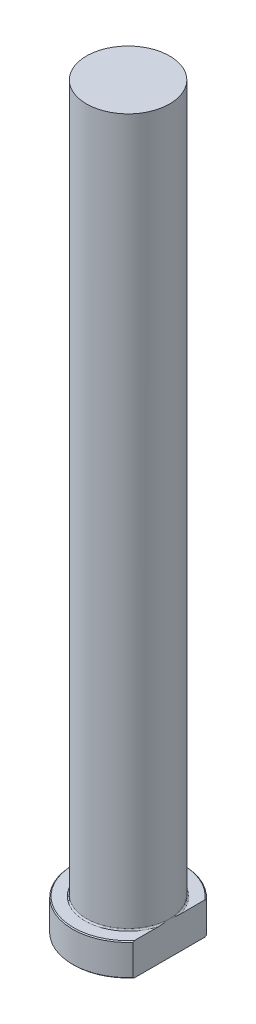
ISO-10303-21;
HEADER;
FILE_DESCRIPTION(('STEP AP214'),'2;1');
FILE_NAME('part.step','',(''),(''),'','','');
FILE_SCHEMA(('AUTOMOTIVE_DESIGN { 1 0 10303 214 1 1 1 1 }'));
ENDSEC;
DATA;
#1=APPLICATION_CONTEXT('core data for automotive mechanical design processes');
#2=APPLICATION_PROTOCOL_DEFINITION('international standard','automotive_design',2000,#1);
#3=PRODUCT_CONTEXT('',#1,'mechanical');
#4=PRODUCT('Part','Part','',(#3));
#5=PRODUCT_RELATED_PRODUCT_CATEGORY('part','',(#4));
#6=PRODUCT_DEFINITION_FORMATION('','',#4);
#7=PRODUCT_DEFINITION_CONTEXT('part definition',#1,'design');
#8=PRODUCT_DEFINITION('design','',#6,#7);
#9=PRODUCT_DEFINITION_SHAPE('','',#8);
#10=(LENGTH_UNIT() NAMED_UNIT(*) SI_UNIT(.MILLI.,.METRE.));
#11=(NAMED_UNIT(*) PLANE_ANGLE_UNIT() SI_UNIT($,.RADIAN.));
#12=(NAMED_UNIT(*) SI_UNIT($,.STERADIAN.) SOLID_ANGLE_UNIT());
#13=UNCERTAINTY_MEASURE_WITH_UNIT(LENGTH_MEASURE(1.E-05),#10,'distance_accuracy_value','');
#14=(GEOMETRIC_REPRESENTATION_CONTEXT(3) GLOBAL_UNCERTAINTY_ASSIGNED_CONTEXT((#13)) GLOBAL_UNIT_ASSIGNED_CONTEXT((#10,
#11,#12)) REPRESENTATION_CONTEXT('',''));
#15=CARTESIAN_POINT('',(0.,0.,0.));
#16=DIRECTION('',(0.,0.,1.));
#17=DIRECTION('',(1.,0.,0.));
#18=AXIS2_PLACEMENT_3D('',#15,#16,#17);
#19=CARTESIAN_POINT('',(0.,0.,0.));
#20=DIRECTION('',(0.,-1.,0.));
#21=DIRECTION('',(0.,0.,-1.));
#22=AXIS2_PLACEMENT_3D('',#19,#20,#21);
#23=PLANE('',#22);
#24=CARTESIAN_POINT('',(0.,0.,0.));
#25=DIRECTION('',(0.,-1.,0.));
#26=DIRECTION('',(0.,0.,-1.));
#27=AXIS2_PLACEMENT_3D('',#24,#25,#26);
#28=CIRCLE('',#27,11.8);
#29=CARTESIAN_POINT('',(8.99999999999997,0.,7.63151361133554));
#30=VERTEX_POINT('',#29);
#31=CARTESIAN_POINT('',(8.99999999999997,0.,-7.63151361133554));
#32=VERTEX_POINT('',#31);
#33=EDGE_CURVE('E98',#30,#32,#28,.T.);
#34=ORIENTED_EDGE('',*,*,#33,.T.);
#35=DIRECTION('',(0.,0.,1.));
#36=VECTOR('',#35,1.);
#37=CARTESIAN_POINT('',(8.99999999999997,0.,-7.93725393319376));
#38=LINE('',#37,#36);
#39=EDGE_CURVE('E83',#32,#30,#38,.T.);
#40=ORIENTED_EDGE('',*,*,#39,.T.);
#41=EDGE_LOOP('',(#34,#40));
#42=FACE_BOUND('',#41,.T.);
#43=ADVANCED_FACE('F32',(#42),#23,.T.);
#44=CARTESIAN_POINT('',(0.,259.958771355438,0.));
#45=DIRECTION('',(0.,1.,0.));
#46=DIRECTION('',(0.,0.,1.));
#47=AXIS2_PLACEMENT_3D('',#44,#45,#46);
#48=CYLINDRICAL_SURFACE('',#47,12.);
#49=CARTESIAN_POINT('',(0.,6.79999999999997,0.));
#50=DIRECTION('',(0.,1.,0.));
#51=DIRECTION('',(0.,0.,1.));
#52=AXIS2_PLACEMENT_3D('',#49,#50,#51);
#53=CIRCLE('',#52,12.);
#54=CARTESIAN_POINT('',(8.99999999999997,6.79999999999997,7.93725393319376));
#55=VERTEX_POINT('',#54);
#56=CARTESIAN_POINT('',(8.99999999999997,6.79999999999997,-7.93725393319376));
#57=VERTEX_POINT('',#56);
#58=EDGE_CURVE('E104',#55,#57,#53,.F.);
#59=ORIENTED_EDGE('',*,*,#58,.T.);
#60=DIRECTION('',(0.,-1.,0.));
#61=VECTOR('',#60,1.);
#62=CARTESIAN_POINT('',(8.99999999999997,160.,-7.93725393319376));
#63=LINE('',#62,#61);
#64=CARTESIAN_POINT('',(8.99999999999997,0.199999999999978,-7.93725393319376));
#65=VERTEX_POINT('',#64);
#66=EDGE_CURVE('E183',#57,#65,#63,.T.);
#67=ORIENTED_EDGE('',*,*,#66,.T.);
#68=CARTESIAN_POINT('',(0.,0.199999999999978,0.));
#69=DIRECTION('',(0.,-1.,0.));
#70=DIRECTION('',(0.,0.,-1.));
#71=AXIS2_PLACEMENT_3D('',#68,#69,#70);
#72=CIRCLE('',#71,12.);
#73=CARTESIAN_POINT('',(8.99999999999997,0.199999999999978,7.93725393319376));
#74=VERTEX_POINT('',#73);
#75=EDGE_CURVE('E100',#65,#74,#72,.F.);
#76=ORIENTED_EDGE('',*,*,#75,.T.);
#77=DIRECTION('',(0.,-1.,0.));
#78=VECTOR('',#77,1.);
#79=CARTESIAN_POINT('',(8.99999999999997,160.,7.93725393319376));
#80=LINE('',#79,#78);
#81=EDGE_CURVE('E93',#55,#74,#80,.T.);
#82=ORIENTED_EDGE('',*,*,#81,.F.);
#83=EDGE_LOOP('',(#59,#67,#76,#82));
#84=FACE_BOUND('',#83,.T.);
#85=ADVANCED_FACE('F158',(#84),#48,.T.);
#86=CARTESIAN_POINT('',(-12.,7.,0.));
#87=DIRECTION('',(0.,1.,0.));
#88=DIRECTION('',(0.,0.,1.));
#89=AXIS2_PLACEMENT_3D('',#86,#87,#88);
#90=PLANE('',#89);
#91=CARTESIAN_POINT('',(0.,7.,0.));
#92=DIRECTION('',(0.,1.,0.));
#93=DIRECTION('',(0.,0.,1.));
#94=AXIS2_PLACEMENT_3D('',#91,#92,#93);
#95=CIRCLE('',#94,11.8);
#96=CARTESIAN_POINT('',(8.99999999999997,7.,-7.63151361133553));
#97=VERTEX_POINT('',#96);
#98=CARTESIAN_POINT('',(8.99999999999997,7.,7.63151361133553));
#99=VERTEX_POINT('',#98);
#100=EDGE_CURVE('E178',#97,#99,#95,.T.);
#101=ORIENTED_EDGE('',*,*,#100,.T.);
#102=DIRECTION('',(0.,0.,-1.));
#103=VECTOR('',#102,1.);
#104=CARTESIAN_POINT('',(8.99999999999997,7.,0.));
#105=LINE('',#104,#103);
#106=CARTESIAN_POINT('',(8.99999999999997,6.99999999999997,2.34307490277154));
#107=VERTEX_POINT('',#106);
#108=EDGE_CURVE('E57',#99,#107,#105,.T.);
#109=ORIENTED_EDGE('',*,*,#108,.T.);
#110=CARTESIAN_POINT('',(0.,7.,0.));
#111=DIRECTION('',(0.,1.,0.));
#112=DIRECTION('',(0.,0.,1.));
#113=AXIS2_PLACEMENT_3D('',#110,#111,#112);
#114=CIRCLE('',#113,9.29999999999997);
#115=CARTESIAN_POINT('',(8.99999999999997,6.99999999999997,-2.34307490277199));
#116=VERTEX_POINT('',#115);
#117=EDGE_CURVE('E107',#107,#116,#114,.F.);
#118=ORIENTED_EDGE('',*,*,#117,.T.);
#119=EDGE_CURVE('E136',#116,#97,#105,.T.);
#120=ORIENTED_EDGE('',*,*,#119,.T.);
#121=EDGE_LOOP('',(#101,#109,#118,#120));
#122=FACE_BOUND('',#121,.T.);
#123=ADVANCED_FACE('F147',(#122),#90,.T.);
#124=CARTESIAN_POINT('',(0.,7.00000000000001,0.));
#125=DIRECTION('',(0.,-1.,0.));
#126=DIRECTION('',(0.,0.,-1.));
#127=AXIS2_PLACEMENT_3D('',#124,#125,#126);
#128=CONICAL_SURFACE('',#127,11.7999999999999,0.785398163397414);
#129=ORIENTED_EDGE('',*,*,#58,.F.);
#130=CARTESIAN_POINT('',(8.99999999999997,-0.845696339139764,17.4629145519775));
#131=CARTESIAN_POINT('',(8.99999999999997,-0.619168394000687,17.2080654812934));
#132=CARTESIAN_POINT('',(8.99999999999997,-0.393215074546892,16.9527052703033));
#133=CARTESIAN_POINT('',(8.99999999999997,0.0573779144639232,16.4408231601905));
#134=CARTESIAN_POINT('',(8.99999999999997,0.282017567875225,16.1843012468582));
#135=CARTESIAN_POINT('',(8.99999999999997,0.953874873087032,15.4126051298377));
#136=CARTESIAN_POINT('',(8.99999999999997,1.39886493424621,14.8954867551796));
#137=CARTESIAN_POINT('',(8.99999999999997,2.28707339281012,13.8475750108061));
#138=CARTESIAN_POINT('',(8.99999999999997,2.73018564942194,13.3166913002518));
#139=CARTESIAN_POINT('',(8.99999999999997,3.38667359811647,12.5137605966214));
#140=CARTESIAN_POINT('',(8.99999999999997,3.60411991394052,12.2450411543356));
#141=CARTESIAN_POINT('',(8.99999999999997,4.03580182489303,11.7050379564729));
#142=CARTESIAN_POINT('',(8.99999999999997,4.25003746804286,11.4337542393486));
#143=CARTESIAN_POINT('',(8.99999999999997,4.66485476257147,10.9008707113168));
#144=CARTESIAN_POINT('',(8.99999999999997,4.8656088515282,10.6394052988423));
#145=CARTESIAN_POINT('',(8.99999999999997,5.26299613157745,10.1133666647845));
#146=CARTESIAN_POINT('',(8.99999999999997,5.45962943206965,9.84879352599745));
#147=CARTESIAN_POINT('',(8.99999999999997,5.84808590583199,9.31586751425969));
#148=CARTESIAN_POINT('',(8.99999999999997,6.039905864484,9.04751229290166));
#149=CARTESIAN_POINT('',(8.99999999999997,6.41755379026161,8.5066135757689));
#150=CARTESIAN_POINT('',(8.99999999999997,6.60338186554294,8.23407015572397));
#151=CARTESIAN_POINT('',(8.99999999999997,6.96709703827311,7.68503423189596));
#152=CARTESIAN_POINT('',(8.99999999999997,7.14500871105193,7.40855806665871));
#153=CARTESIAN_POINT('',(8.99999999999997,7.49185621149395,6.84996824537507));
#154=CARTESIAN_POINT('',(8.99999999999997,7.66079116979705,6.56785404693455));
#155=CARTESIAN_POINT('',(8.99999999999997,7.98727106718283,5.99747808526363));
#156=CARTESIAN_POINT('',(8.99999999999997,8.14482812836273,5.70922330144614));
#157=CARTESIAN_POINT('',(8.99999999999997,8.4458607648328,5.12549650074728));
#158=CARTESIAN_POINT('',(8.99999999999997,8.58934045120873,4.83002662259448));
#159=CARTESIAN_POINT('',(8.99999999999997,8.84906483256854,4.25238874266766));
#160=CARTESIAN_POINT('',(8.99999999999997,8.96652090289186,3.97076984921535));
#161=CARTESIAN_POINT('',(8.99999999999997,9.1826864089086,3.40034514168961));
#162=CARTESIAN_POINT('',(8.99999999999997,9.28139598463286,3.1115393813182));
#163=CARTESIAN_POINT('',(8.99999999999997,9.4556676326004,2.52852903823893));
#164=CARTESIAN_POINT('',(8.99999999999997,9.53134480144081,2.23435935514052));
#165=CARTESIAN_POINT('',(8.99999999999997,9.65632576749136,1.64041484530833));
#166=CARTESIAN_POINT('',(8.99999999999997,9.70563300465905,1.34064075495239));
#167=CARTESIAN_POINT('',(8.99999999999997,9.77526514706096,0.73345334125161));
#168=CARTESIAN_POINT('',(8.99999999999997,9.79517814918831,0.425991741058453));
#169=CARTESIAN_POINT('',(8.99999999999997,9.80326622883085,-0.189338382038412));
#170=CARTESIAN_POINT('',(8.99999999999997,9.7914430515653,-0.497206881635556));
#171=CARTESIAN_POINT('',(8.99999999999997,9.73685194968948,-1.11106012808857));
#172=CARTESIAN_POINT('',(8.99999999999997,9.69399186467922,-1.41703652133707));
#173=CARTESIAN_POINT('',(8.99999999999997,9.58011156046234,-2.02367348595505));
#174=CARTESIAN_POINT('',(8.99999999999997,9.50908374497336,-2.32433260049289));
#175=CARTESIAN_POINT('',(8.99999999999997,9.31275981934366,-3.02635448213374));
#176=CARTESIAN_POINT('',(8.99999999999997,9.17712713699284,-3.42480429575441));
#177=CARTESIAN_POINT('',(8.99999999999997,8.87133996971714,-4.20817933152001));
#178=CARTESIAN_POINT('',(8.99999999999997,8.70116358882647,-4.59309579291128));
#179=CARTESIAN_POINT('',(8.99999999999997,8.42568509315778,-5.16277807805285));
#180=CARTESIAN_POINT('',(8.99999999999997,8.32997694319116,-5.3522881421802));
#181=CARTESIAN_POINT('',(8.99999999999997,8.13285287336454,-5.72832390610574));
#182=CARTESIAN_POINT('',(8.99999999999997,8.03143692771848,-5.91484959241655));
#183=CARTESIAN_POINT('',(8.99999999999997,7.8237269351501,-6.28506428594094));
#184=CARTESIAN_POINT('',(8.99999999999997,7.71743466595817,-6.46875429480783));
#185=CARTESIAN_POINT('',(8.99999999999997,7.50059460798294,-6.83359939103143));
#186=CARTESIAN_POINT('',(8.99999999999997,7.39004682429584,-7.01475448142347));
#187=CARTESIAN_POINT('',(8.99999999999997,7.12884885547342,-7.4330641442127));
#188=CARTESIAN_POINT('',(8.99999999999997,6.9768081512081,-7.66934990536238));
#189=CARTESIAN_POINT('',(8.99999999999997,6.66732030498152,-8.13836281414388));
#190=CARTESIAN_POINT('',(8.99999999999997,6.50987281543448,-8.37108973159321));
#191=CARTESIAN_POINT('',(8.99999999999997,6.19040265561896,-8.83345273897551));
#192=CARTESIAN_POINT('',(8.99999999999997,6.02837897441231,-9.06308812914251));
#193=CARTESIAN_POINT('',(8.99999999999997,5.70047733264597,-9.51959402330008));
#194=CARTESIAN_POINT('',(8.99999999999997,5.53459926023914,-9.74646444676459));
#195=CARTESIAN_POINT('',(8.99999999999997,5.03154469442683,-10.4241247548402));
#196=CARTESIAN_POINT('',(8.99999999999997,4.68944039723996,-10.8712583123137));
#197=CARTESIAN_POINT('',(8.99999999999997,3.9955806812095,-11.7578381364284));
#198=CARTESIAN_POINT('',(8.99999999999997,3.64382644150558,-12.1972853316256));
#199=CARTESIAN_POINT('',(8.99999999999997,2.95317269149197,-13.0452636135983));
#200=CARTESIAN_POINT('',(8.99999999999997,2.61468309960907,-13.4541293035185));
#201=CARTESIAN_POINT('',(8.99999999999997,1.93249184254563,-14.2675092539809));
#202=CARTESIAN_POINT('',(8.99999999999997,1.58878996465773,-14.6720233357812));
#203=CARTESIAN_POINT('',(8.99999999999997,0.898519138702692,-15.4759626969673));
#204=CARTESIAN_POINT('',(8.99999999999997,0.551965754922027,-15.8754013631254));
#205=CARTESIAN_POINT('',(8.99999999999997,-0.144511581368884,-16.6712645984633));
#206=CARTESIAN_POINT('',(8.99999999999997,-0.494435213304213,-17.0676894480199));
#207=CARTESIAN_POINT('',(8.99999999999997,-0.845696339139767,-17.4629145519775));
#208=B_SPLINE_CURVE_WITH_KNOTS('',3,(#130,#131,#132,#133,#134,#135,#136,#137,#138,#139,#140,
#141,#142,#143,#144,#145,#146,#147,#148,#149,#150,#151,#152,#153,#154,#155,#156,#157,#158,#159,
#160,#161,#162,#163,#164,#165,#166,#167,#168,#169,#170,#171,#172,#173,#174,#175,#176,#177,#178,
#179,#180,#181,#182,#183,#184,#185,#186,#187,#188,#189,#190,#191,#192,#193,#194,#195,#196,#197,
#198,#199,#200,#201,#202,#203,#204,#205,#206,#207),.UNSPECIFIED.,.F.,.F.,(4,2,2,2,2,2,2,2,2,2,2,
2,2,2,2,2,2,2,2,2,2,2,2,2,2,2,2,2,2,2,2,2,2,2,2,2,2,2,4),(0.,1.02291971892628,2.04585198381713,
4.09246471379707,6.16687312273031,7.20388686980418,8.24088509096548,9.22978878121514,
10.2186661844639,11.2081873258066,12.197690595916,13.1838703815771,14.1701455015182,
15.1553538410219,16.1402736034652,17.0551241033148,17.9699677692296,18.8801617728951,
19.7902370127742,20.7129479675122,21.6356081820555,22.5610194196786,23.4866803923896,
24.7471780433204,26.0084771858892,26.6453205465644,27.2821667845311,27.9187826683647,
28.5553977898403,29.3982316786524,30.2411198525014,31.0841957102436,31.9272960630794,
33.6160766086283,35.3046517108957,36.8969911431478,38.4893957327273,40.0758348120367,
41.6621244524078),.UNSPECIFIED.);
#209=EDGE_CURVE('E135',#55,#99,#208,.T.);
#210=ORIENTED_EDGE('',*,*,#209,.T.);
#211=ORIENTED_EDGE('',*,*,#100,.F.);
#212=EDGE_CURVE('E127',#97,#57,#208,.T.);
#213=ORIENTED_EDGE('',*,*,#212,.T.);
#214=EDGE_LOOP('',(#129,#210,#211,#213));
#215=FACE_BOUND('',#214,.T.);
#216=ADVANCED_FACE('F143',(#215),#128,.T.);
#217=CARTESIAN_POINT('',(0.,0.199999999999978,0.));
#218=DIRECTION('',(0.,1.,0.));
#219=DIRECTION('',(0.,0.,1.));
#220=AXIS2_PLACEMENT_3D('',#217,#218,#219);
#221=CONICAL_SURFACE('',#220,12.,0.785398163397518);
#222=ORIENTED_EDGE('',*,*,#75,.F.);
#223=CARTESIAN_POINT('',(8.99999999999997,7.84569633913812,-17.4629145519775));
#224=CARTESIAN_POINT('',(8.99999999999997,7.61916839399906,-17.2080654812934));
#225=CARTESIAN_POINT('',(8.99999999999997,7.39321507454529,-16.9527052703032));
#226=CARTESIAN_POINT('',(8.99999999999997,6.9426220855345,-16.4408231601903));
#227=CARTESIAN_POINT('',(8.99999999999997,6.71798243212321,-16.184301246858));
#228=CARTESIAN_POINT('',(8.99999999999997,6.04612512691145,-15.4126051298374));
#229=CARTESIAN_POINT('',(8.99999999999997,5.60113506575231,-14.8954867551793));
#230=CARTESIAN_POINT('',(8.99999999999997,4.71292660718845,-13.8475750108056));
#231=CARTESIAN_POINT('',(8.99999999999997,4.26981435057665,-13.3166913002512));
#232=CARTESIAN_POINT('',(8.99999999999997,3.61332640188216,-12.5137605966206));
#233=CARTESIAN_POINT('',(8.99999999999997,3.39588008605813,-12.2450411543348));
#234=CARTESIAN_POINT('',(8.99999999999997,2.96419817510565,-11.705037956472));
#235=CARTESIAN_POINT('',(8.99999999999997,2.74996253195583,-11.4337542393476));
#236=CARTESIAN_POINT('',(8.99999999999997,2.33514523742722,-10.9008707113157));
#237=CARTESIAN_POINT('',(8.99999999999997,2.13439114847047,-10.6394052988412));
#238=CARTESIAN_POINT('',(8.99999999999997,1.73700386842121,-10.1133666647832));
#239=CARTESIAN_POINT('',(8.99999999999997,1.54037056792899,-9.84879352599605));
#240=CARTESIAN_POINT('',(8.99999999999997,1.15191409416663,-9.31586751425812));
#241=CARTESIAN_POINT('',(8.99999999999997,0.960094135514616,-9.0475122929));
#242=CARTESIAN_POINT('',(8.99999999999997,0.582446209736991,-8.50661357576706));
#243=CARTESIAN_POINT('',(8.99999999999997,0.396618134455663,-8.23407015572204));
#244=CARTESIAN_POINT('',(8.99999999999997,0.0329029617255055,-7.68503423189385));
#245=CARTESIAN_POINT('',(8.99999999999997,-0.145008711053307,-7.4085580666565));
#246=CARTESIAN_POINT('',(8.99999999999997,-0.491856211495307,-6.84996824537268));
#247=CARTESIAN_POINT('',(8.99999999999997,-0.660791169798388,-6.56785404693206));
#248=CARTESIAN_POINT('',(8.99999999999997,-0.987271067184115,-5.99747808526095));
#249=CARTESIAN_POINT('',(8.99999999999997,-1.14482812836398,-5.70922330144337));
#250=CARTESIAN_POINT('',(8.99999999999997,-1.44586076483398,-5.12549650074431));
#251=CARTESIAN_POINT('',(8.99999999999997,-1.58934045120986,-4.8300266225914));
#252=CARTESIAN_POINT('',(8.99999999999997,-1.84906483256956,-4.25238874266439));
#253=CARTESIAN_POINT('',(8.99999999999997,-1.96652090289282,-3.970769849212));
#254=CARTESIAN_POINT('',(8.99999999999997,-2.18268640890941,-3.40034514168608));
#255=CARTESIAN_POINT('',(8.99999999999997,-2.28139598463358,-3.11153938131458));
#256=CARTESIAN_POINT('',(8.99999999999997,-2.45566763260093,-2.52852903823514));
#257=CARTESIAN_POINT('',(8.99999999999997,-2.53134480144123,-2.23435935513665));
#258=CARTESIAN_POINT('',(8.99999999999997,-2.65632576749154,-1.6404148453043));
#259=CARTESIAN_POINT('',(8.99999999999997,-2.70563300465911,-1.34064075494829));
#260=CARTESIAN_POINT('',(8.99999999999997,-2.77526514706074,-0.733453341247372));
#261=CARTESIAN_POINT('',(8.99999999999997,-2.79517814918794,-0.425991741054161));
#262=CARTESIAN_POINT('',(8.99999999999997,-2.80326622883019,0.189338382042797));
#263=CARTESIAN_POINT('',(8.99999999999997,-2.79144305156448,0.497206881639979));
#264=CARTESIAN_POINT('',(8.99999999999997,-2.73685194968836,1.11106012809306));
#265=CARTESIAN_POINT('',(8.99999999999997,-2.69399186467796,1.41703652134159));
#266=CARTESIAN_POINT('',(8.99999999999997,-2.5801115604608,2.02367348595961));
#267=CARTESIAN_POINT('',(8.99999999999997,-2.5090837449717,2.32433260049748));
#268=CARTESIAN_POINT('',(8.99999999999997,-2.3127598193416,3.02635448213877));
#269=CARTESIAN_POINT('',(8.99999999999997,-2.17712713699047,3.42480429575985));
#270=CARTESIAN_POINT('',(8.99999999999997,-1.87133996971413,4.20817933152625));
#271=CARTESIAN_POINT('',(8.99999999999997,-1.70116358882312,4.59309579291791));
#272=CARTESIAN_POINT('',(8.99999999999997,-1.42568509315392,5.16277807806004));
#273=CARTESIAN_POINT('',(8.99999999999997,-1.32997694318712,5.35228814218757));
#274=CARTESIAN_POINT('',(8.99999999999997,-1.13285287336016,5.72832390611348));
#275=CARTESIAN_POINT('',(8.99999999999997,-1.03143692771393,5.91484959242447));
#276=CARTESIAN_POINT('',(8.99999999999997,-0.823726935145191,6.28506428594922));
#277=CARTESIAN_POINT('',(8.99999999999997,-0.717434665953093,6.46875429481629));
#278=CARTESIAN_POINT('',(8.99999999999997,-0.500594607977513,6.83359939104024));
#279=CARTESIAN_POINT('',(8.99999999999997,-0.390046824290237,7.01475448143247));
#280=CARTESIAN_POINT('',(8.99999999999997,-0.128848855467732,7.4330641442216));
#281=CARTESIAN_POINT('',(8.99999999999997,0.0231918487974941,7.66934990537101));
#282=CARTESIAN_POINT('',(8.99999999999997,0.332679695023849,8.13836281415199));
#283=CARTESIAN_POINT('',(8.99999999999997,0.490127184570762,8.37108973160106));
#284=CARTESIAN_POINT('',(8.99999999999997,0.809597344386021,8.83345273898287));
#285=CARTESIAN_POINT('',(8.99999999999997,0.971621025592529,9.06308812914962));
#286=CARTESIAN_POINT('',(8.99999999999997,1.29952266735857,9.51959402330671));
#287=CARTESIAN_POINT('',(8.99999999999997,1.46540073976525,9.74646444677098));
#288=CARTESIAN_POINT('',(8.99999999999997,1.96845530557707,10.4241247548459));
#289=CARTESIAN_POINT('',(8.99999999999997,2.3105596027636,10.8712583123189));
#290=CARTESIAN_POINT('',(8.99999999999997,3.00441931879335,11.7578381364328));
#291=CARTESIAN_POINT('',(8.99999999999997,3.35617355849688,12.1972853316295));
#292=CARTESIAN_POINT('',(8.99999999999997,4.04682730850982,13.0452636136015));
#293=CARTESIAN_POINT('',(8.99999999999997,4.38531690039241,13.4541293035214));
#294=CARTESIAN_POINT('',(8.99999999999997,5.06750815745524,14.2675092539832));
#295=CARTESIAN_POINT('',(8.99999999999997,5.41121003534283,14.6720233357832));
#296=CARTESIAN_POINT('',(8.99999999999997,6.10148086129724,15.4759626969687));
#297=CARTESIAN_POINT('',(8.99999999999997,6.4480342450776,15.8754013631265));
#298=CARTESIAN_POINT('',(8.99999999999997,7.14451158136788,16.6712645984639));
#299=CARTESIAN_POINT('',(8.99999999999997,7.49443521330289,17.0676894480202));
#300=CARTESIAN_POINT('',(8.99999999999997,7.84569633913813,17.4629145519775));
#301=B_SPLINE_CURVE_WITH_KNOTS('',3,(#223,#224,#225,#226,#227,#228,#229,#230,#231,#232,#233,
#234,#235,#236,#237,#238,#239,#240,#241,#242,#243,#244,#245,#246,#247,#248,#249,#250,#251,#252,
#253,#254,#255,#256,#257,#258,#259,#260,#261,#262,#263,#264,#265,#266,#267,#268,#269,#270,#271,
#272,#273,#274,#275,#276,#277,#278,#279,#280,#281,#282,#283,#284,#285,#286,#287,#288,#289,#290,
#291,#292,#293,#294,#295,#296,#297,#298,#299,#300),.UNSPECIFIED.,.F.,.F.,(4,2,2,2,2,2,2,2,2,2,2,
2,2,2,2,2,2,2,2,2,2,2,2,2,2,2,2,2,2,2,2,2,2,2,2,2,2,2,4),(0.,1.02291971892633,2.04585198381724,
4.09246471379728,6.16687312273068,7.20388686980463,8.240885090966,9.22978878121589,
10.2186661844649,11.2081873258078,12.1976905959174,13.1838703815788,14.1701455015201,
15.155353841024,16.1402736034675,17.0551241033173,17.9699677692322,18.8801617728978,
19.7902370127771,20.7129479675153,21.6356081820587,22.561019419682,23.4866803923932,
24.7471780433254,26.0084771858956,26.6453205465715,27.282166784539,27.9187826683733,
28.5553977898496,29.3982316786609,30.2411198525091,31.0841957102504,31.9272960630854,
33.6160766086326,35.3046517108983,36.8969911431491,38.4893957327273,40.0758348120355,
41.6621244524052),.UNSPECIFIED.);
#302=EDGE_CURVE('E86',#65,#32,#301,.T.);
#303=ORIENTED_EDGE('',*,*,#302,.T.);
#304=ORIENTED_EDGE('',*,*,#33,.F.);
#305=EDGE_CURVE('E89',#30,#74,#301,.T.);
#306=ORIENTED_EDGE('',*,*,#305,.T.);
#307=EDGE_LOOP('',(#222,#303,#304,#306));
#308=FACE_BOUND('',#307,.T.);
#309=ADVANCED_FACE('F97',(#308),#221,.T.);
#310=CARTESIAN_POINT('',(0.,7.29999999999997,0.));
#311=DIRECTION('',(0.,1.,0.));
#312=DIRECTION('',(0.,0.,1.));
#313=AXIS2_PLACEMENT_3D('',#310,#311,#312);
#314=TOROIDAL_SURFACE('',#313,9.29999999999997,0.3);
#315=CARTESIAN_POINT('',(8.99999999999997,7.29999999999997,0.));
#316=CARTESIAN_POINT('',(8.99999999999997,7.30000063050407,1.40628521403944E-10));
#317=CARTESIAN_POINT('',(8.99999999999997,7.30000126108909,-3.72953344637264E-07));
#318=CARTESIAN_POINT('',(8.99999999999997,7.30000242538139,-1.31879172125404E-06));
#319=CARTESIAN_POINT('',(8.99999999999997,7.30000291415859,-1.91658985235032E-06));
#320=CARTESIAN_POINT('',(8.99999999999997,7.30000399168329,-3.38116402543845E-06));
#321=CARTESIAN_POINT('',(8.99999999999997,7.30000455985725,-4.27141237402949E-06));
#322=CARTESIAN_POINT('',(8.99999999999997,7.30000552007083,-6.05655817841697E-06));
#323=CARTESIAN_POINT('',(8.99999999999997,7.30000592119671,-6.9473471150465E-06));
#324=CARTESIAN_POINT('',(8.99999999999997,7.30000753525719,-1.06072217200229E-05));
#325=CARTESIAN_POINT('',(8.99999999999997,7.30000869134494,-1.34079715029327E-05));
#326=CARTESIAN_POINT('',(8.99999999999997,7.30001046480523,-1.87883419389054E-05));
#327=CARTESIAN_POINT('',(8.99999999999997,7.30001113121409,-2.13522964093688E-05));
#328=CARTESIAN_POINT('',(8.99999999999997,7.30001412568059,-3.27400407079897E-05));
#329=CARTESIAN_POINT('',(8.99999999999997,7.30001653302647,-4.15431816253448E-05));
#330=CARTESIAN_POINT('',(8.99999999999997,7.30001987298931,-5.77938726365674E-05));
#331=CARTESIAN_POINT('',(8.99999999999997,7.3000209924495,-6.5202010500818E-05));
#332=CARTESIAN_POINT('',(8.99999999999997,7.30002942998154,-0.000121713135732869));
#333=CARTESIAN_POINT('',(8.99999999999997,7.30003617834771,-0.000170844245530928));
#334=CARTESIAN_POINT('',(8.99999999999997,7.30006567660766,-0.00036702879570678));
#335=CARTESIAN_POINT('',(8.99999999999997,7.30009343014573,-0.00051334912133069));
#336=CARTESIAN_POINT('',(8.99999999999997,7.30020289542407,-0.00109844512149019));
#337=CARTESIAN_POINT('',(8.99999999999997,7.30028164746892,-0.00153755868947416));
#338=CARTESIAN_POINT('',(8.99999999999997,7.30059984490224,-0.00330079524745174));
#339=CARTESIAN_POINT('',(8.99999999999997,7.30084318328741,-0.00462444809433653));
#340=CARTESIAN_POINT('',(8.99999999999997,7.30186346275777,-0.0101867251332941));
#341=CARTESIAN_POINT('',(8.99999999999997,7.30263548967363,-0.0144259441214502));
#342=CARTESIAN_POINT('',(8.99999999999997,7.31325744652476,-0.0727359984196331));
#343=CARTESIAN_POINT('',(8.99999999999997,7.32313962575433,-0.1268031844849));
#344=CARTESIAN_POINT('',(8.99999999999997,7.34392153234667,-0.241097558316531));
#345=CARTESIAN_POINT('',(8.99999999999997,7.35480932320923,-0.301326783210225));
#346=CARTESIAN_POINT('',(8.99999999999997,7.37309736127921,-0.40343148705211));
#347=CARTESIAN_POINT('',(8.99999999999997,7.3805477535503,-0.445297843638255));
#348=CARTESIAN_POINT('',(8.99999999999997,7.39510453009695,-0.527858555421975));
#349=CARTESIAN_POINT('',(8.99999999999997,7.40221466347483,-0.568552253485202));
#350=CARTESIAN_POINT('',(8.99999999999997,7.43458159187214,-0.755924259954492));
#351=CARTESIAN_POINT('',(8.99999999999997,7.45890071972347,-0.902767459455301));
#352=CARTESIAN_POINT('',(8.99999999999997,7.5040883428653,-1.19870226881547));
#353=CARTESIAN_POINT('',(8.99999999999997,7.52491482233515,-1.34780055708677));
#354=CARTESIAN_POINT('',(8.99999999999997,7.55251893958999,-1.57943061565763));
#355=CARTESIAN_POINT('',(8.99999999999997,7.56140010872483,-1.66170929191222));
#356=CARTESIAN_POINT('',(8.99999999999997,7.57684365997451,-1.82648173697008));
#357=CARTESIAN_POINT('',(8.99999999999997,7.58340627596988,-1.90897548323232));
#358=CARTESIAN_POINT('',(8.99999999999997,7.59356547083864,-2.07383798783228));
#359=CARTESIAN_POINT('',(8.99999999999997,7.59717316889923,-2.15620603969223));
#360=CARTESIAN_POINT('',(8.99999999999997,7.60060935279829,-2.32101209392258));
#361=CARTESIAN_POINT('',(8.99999999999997,7.60043940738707,-2.40345005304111));
#362=CARTESIAN_POINT('',(8.99999999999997,7.59640131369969,-2.52537573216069));
#363=CARTESIAN_POINT('',(8.99999999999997,7.59450012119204,-2.56492910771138));
#364=CARTESIAN_POINT('',(8.99999999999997,7.58928802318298,-2.64396909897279));
#365=CARTESIAN_POINT('',(8.99999999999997,7.58597630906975,-2.68345566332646));
#366=CARTESIAN_POINT('',(8.99999999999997,7.57769868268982,-2.76177296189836));
#367=CARTESIAN_POINT('',(8.99999999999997,7.57275348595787,-2.80060581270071));
#368=CARTESIAN_POINT('',(8.99999999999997,7.56078540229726,-2.87793166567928));
#369=CARTESIAN_POINT('',(8.99999999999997,7.55376374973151,-2.91642485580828));
#370=CARTESIAN_POINT('',(8.99999999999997,7.53694450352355,-2.99313780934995));
#371=CARTESIAN_POINT('',(8.99999999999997,7.52712658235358,-3.03135338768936));
#372=CARTESIAN_POINT('',(8.99999999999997,7.50944673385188,-3.08780831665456));
#373=CARTESIAN_POINT('',(8.99999999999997,7.50305127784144,-3.10650508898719));
#374=CARTESIAN_POINT('',(8.99999999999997,7.48902548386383,-3.14342466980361));
#375=CARTESIAN_POINT('',(8.99999999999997,7.48139609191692,-3.16164782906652));
#376=CARTESIAN_POINT('',(8.99999999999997,7.46450585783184,-3.19743301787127));
#377=CARTESIAN_POINT('',(8.99999999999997,7.4552376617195,-3.2149916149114));
#378=CARTESIAN_POINT('',(8.99999999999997,7.43454972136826,-3.24876333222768));
#379=CARTESIAN_POINT('',(8.99999999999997,7.42314087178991,-3.26498269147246));
#380=CARTESIAN_POINT('',(8.99999999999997,7.40450419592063,-3.28646803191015));
#381=CARTESIAN_POINT('',(8.99999999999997,7.39850345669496,-3.29278935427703));
#382=CARTESIAN_POINT('',(8.99999999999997,7.38579421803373,-3.30471156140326));
#383=CARTESIAN_POINT('',(8.99999999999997,7.37908470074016,-3.31031138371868));
#384=CARTESIAN_POINT('',(8.99999999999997,7.36478588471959,-3.32053638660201));
#385=CARTESIAN_POINT('',(8.99999999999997,7.35718475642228,-3.32514544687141));
#386=CARTESIAN_POINT('',(8.99999999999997,7.34122980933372,-3.33278362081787));
#387=CARTESIAN_POINT('',(8.99999999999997,7.33287931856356,-3.33581935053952));
#388=CARTESIAN_POINT('',(8.99999999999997,7.31845330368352,-3.33919143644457));
#389=CARTESIAN_POINT('',(8.99999999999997,7.3125065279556,-3.34008113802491));
#390=CARTESIAN_POINT('',(8.99999999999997,7.30054756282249,-3.34082795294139));
#391=CARTESIAN_POINT('',(8.99999999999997,7.29453539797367,-3.34068544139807));
#392=CARTESIAN_POINT('',(8.99999999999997,7.28263753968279,-3.33938340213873));
#393=CARTESIAN_POINT('',(8.99999999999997,7.2767516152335,-3.3382259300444));
#394=CARTESIAN_POINT('',(8.99999999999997,7.26523345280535,-3.33500803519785));
#395=CARTESIAN_POINT('',(8.99999999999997,7.25960143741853,-3.33294683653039));
#396=CARTESIAN_POINT('',(8.99999999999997,7.24614810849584,-3.32695048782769));
#397=CARTESIAN_POINT('',(8.99999999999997,7.23851777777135,-3.32258952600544));
#398=CARTESIAN_POINT('',(8.99999999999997,7.22402940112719,-3.31273429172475));
#399=CARTESIAN_POINT('',(8.99999999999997,7.21717355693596,-3.3072369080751));
#400=CARTESIAN_POINT('',(8.99999999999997,7.19922025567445,-3.29098261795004));
#401=CARTESIAN_POINT('',(8.99999999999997,7.18887056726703,-3.27940951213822));
#402=CARTESIAN_POINT('',(8.99999999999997,7.16988044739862,-3.25496698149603));
#403=CARTESIAN_POINT('',(8.99999999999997,7.16124389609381,-3.24209471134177));
#404=CARTESIAN_POINT('',(8.99999999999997,7.14198013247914,-3.2101081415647));
#405=CARTESIAN_POINT('',(8.99999999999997,7.1320002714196,-3.1906083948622));
#406=CARTESIAN_POINT('',(8.99999999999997,7.11389041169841,-3.15075380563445));
#407=CARTESIAN_POINT('',(8.99999999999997,7.10576438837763,-3.13039723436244));
#408=CARTESIAN_POINT('',(8.99999999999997,7.09086324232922,-3.08897345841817));
#409=CARTESIAN_POINT('',(8.99999999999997,7.08410231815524,-3.06790120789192));
#410=CARTESIAN_POINT('',(8.99999999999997,7.07174209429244,-3.02545099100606));
#411=CARTESIAN_POINT('',(8.99999999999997,7.06614150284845,-3.00407339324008));
#412=CARTESIAN_POINT('',(8.99999999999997,7.05234584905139,-2.94629140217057));
#413=CARTESIAN_POINT('',(8.99999999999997,7.04502112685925,-2.90967972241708));
#414=CARTESIAN_POINT('',(8.99999999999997,7.03240402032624,-2.8361022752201));
#415=CARTESIAN_POINT('',(8.99999999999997,7.02711280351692,-2.79913631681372));
#416=CARTESIAN_POINT('',(8.99999999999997,7.01363050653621,-2.68772710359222));
#417=CARTESIAN_POINT('',(8.99999999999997,7.00787651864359,-2.61298996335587));
#418=CARTESIAN_POINT('',(8.99999999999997,7.00101064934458,-2.46619763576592));
#419=CARTESIAN_POINT('',(8.99999999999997,6.99973066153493,-2.39414846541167));
#420=CARTESIAN_POINT('',(8.99999999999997,7.0003597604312,-2.25048360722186));
#421=CARTESIAN_POINT('',(8.99999999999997,7.00225057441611,-2.17886780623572));
#422=CARTESIAN_POINT('',(8.99999999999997,7.00865827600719,-2.0325544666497));
#423=CARTESIAN_POINT('',(8.99999999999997,7.01328875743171,-1.95786225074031));
#424=CARTESIAN_POINT('',(8.99999999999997,7.0247141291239,-1.80868969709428));
#425=CARTESIAN_POINT('',(8.99999999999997,7.03150781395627,-1.73420926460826));
#426=CARTESIAN_POINT('',(8.99999999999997,7.04702589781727,-1.583650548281));
#427=CARTESIAN_POINT('',(8.99999999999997,7.05579262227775,-1.50757669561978));
#428=CARTESIAN_POINT('',(8.99999999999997,7.07482366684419,-1.35540828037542));
#429=CARTESIAN_POINT('',(8.99999999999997,7.08509200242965,-1.27931422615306));
#430=CARTESIAN_POINT('',(8.99999999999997,7.11096614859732,-1.09814766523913));
#431=CARTESIAN_POINT('',(8.99999999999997,7.12710877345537,-0.993152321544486));
#432=CARTESIAN_POINT('',(8.99999999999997,7.16076002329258,-0.784642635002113));
#433=CARTESIAN_POINT('',(8.99999999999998,7.17825049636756,-0.681125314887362));
#434=CARTESIAN_POINT('',(8.99999999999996,7.21207189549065,-0.486473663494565));
#435=CARTESIAN_POINT('',(8.99999999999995,7.22829584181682,-0.395320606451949));
#436=CARTESIAN_POINT('',(8.99999999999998,7.25335230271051,-0.256199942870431));
#437=CARTESIAN_POINT('',(9.,7.26204965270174,-0.208207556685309));
#438=CARTESIAN_POINT('',(8.99999999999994,7.27937243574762,-0.113033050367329));
#439=CARTESIAN_POINT('',(8.99999999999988,7.2879966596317,-0.0658507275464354));
#440=CARTESIAN_POINT('',(8.99999999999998,7.29736684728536,-0.0144131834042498));
#441=CARTESIAN_POINT('',(8.99999999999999,7.29814117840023,-0.0101611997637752));
#442=CARTESIAN_POINT('',(8.99999999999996,7.29916198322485,-0.00459610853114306));
#443=CARTESIAN_POINT('',(8.99999999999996,7.29940349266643,-0.00328239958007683));
#444=CARTESIAN_POINT('',(8.99999999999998,7.29971946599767,-0.00153148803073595));
#445=CARTESIAN_POINT('',(8.99999999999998,7.2997977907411,-0.00109475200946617));
#446=CARTESIAN_POINT('',(8.99999999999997,7.29990674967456,-0.000512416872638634));
#447=CARTESIAN_POINT('',(8.99999999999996,7.29993443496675,-0.000366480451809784));
#448=CARTESIAN_POINT('',(8.99999999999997,7.29996386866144,-0.00017073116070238));
#449=CARTESIAN_POINT('',(8.99999999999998,7.29997060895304,-0.000121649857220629));
#450=CARTESIAN_POINT('',(8.99999999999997,7.29997903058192,-6.51901500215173E-05));
#451=CARTESIAN_POINT('',(8.99999999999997,7.29998014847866,-5.7784383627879E-05));
#452=CARTESIAN_POINT('',(8.99999999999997,7.29998348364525,-4.15389236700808E-05));
#453=CARTESIAN_POINT('',(8.99999999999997,7.29998588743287,-3.27385309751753E-05));
#454=CARTESIAN_POINT('',(8.99999999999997,7.29998887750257,-2.13537218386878E-05));
#455=CARTESIAN_POINT('',(8.99999999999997,7.29998954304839,-1.87899411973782E-05));
#456=CARTESIAN_POINT('',(8.99999999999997,7.29999131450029,-1.34098146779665E-05));
#457=CARTESIAN_POINT('',(8.99999999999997,7.29999246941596,-1.0609109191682E-05));
#458=CARTESIAN_POINT('',(8.99999999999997,7.29999408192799,-6.94916941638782E-06));
#459=CARTESIAN_POINT('',(8.99999999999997,7.29999448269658,-6.05831006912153E-06));
#460=CARTESIAN_POINT('',(8.99999999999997,7.29999544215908,-4.27295929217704E-06));
#461=CARTESIAN_POINT('',(8.99999999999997,7.29999600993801,-3.38257168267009E-06));
#462=CARTESIAN_POINT('',(8.99999999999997,7.29999708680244,-1.91768845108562E-06));
#463=CARTESIAN_POINT('',(8.99999999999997,7.29999757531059,-1.3197344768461E-06));
#464=CARTESIAN_POINT('',(8.99999999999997,7.29999873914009,-3.73475936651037E-07));
#465=CARTESIAN_POINT('',(8.99999999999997,7.29999936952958,-1.40621003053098E-10));
#466=CARTESIAN_POINT('',(8.99999999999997,7.29999999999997,0.));
#467=B_SPLINE_CURVE_WITH_KNOTS('',3,(#315,#316,#317,#318,#319,#320,#321,#322,#323,#324,#325,
#326,#327,#328,#329,#330,#331,#332,#333,#334,#335,#336,#337,#338,#339,#340,#341,#342,#343,#344,
#345,#346,#347,#348,#349,#350,#351,#352,#353,#354,#355,#356,#357,#358,#359,#360,#361,#362,#363,
#364,#365,#366,#367,#368,#369,#370,#371,#372,#373,#374,#375,#376,#377,#378,#379,#380,#381,#382,
#383,#384,#385,#386,#387,#388,#389,#390,#391,#392,#393,#394,#395,#396,#397,#398,#399,#400,#401,
#402,#403,#404,#405,#406,#407,#408,#409,#410,#411,#412,#413,#414,#415,#416,#417,#418,#419,#420,
#421,#422,#423,#424,#425,#426,#427,#428,#429,#430,#431,#432,#433,#434,#435,#436,#437,#438,#439,
#440,#441,#442,#443,#444,#445,#446,#447,#448,#449,#450,#451,#452,#453,#454,#455,#456,#457,#458,
#459,#460,#461,#462,#463,#464,#465,#466),.UNSPECIFIED.,.T.,.F.,(4,2,2,2,2,2,2,2,2,2,2,2,2,2,2,2,
2,2,2,2,2,2,2,2,2,2,2,2,2,2,2,2,2,2,2,2,2,2,2,2,2,2,2,2,2,2,2,2,2,2,2,2,2,2,2,2,2,2,2,2,2,2,2,2,
2,2,2,2,2,2,2,2,2,2,2,4),(0.,1.9618165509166E-06,4.31785402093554E-06,7.45492696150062E-06,
1.03869199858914E-05,1.94514161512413E-05,2.73914962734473E-05,5.47432539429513E-05,
7.71990234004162E-05,0.000226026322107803,0.000672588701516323,0.00201119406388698,
0.00604839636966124,0.0189755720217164,0.183861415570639,0.367478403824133,0.495050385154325,
0.618980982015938,1.06548941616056,1.51703428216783,1.76527968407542,2.01350003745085,
2.26078200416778,2.50796128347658,2.62673893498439,2.74558477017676,2.86297785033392,
2.98030128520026,3.09850038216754,3.15775069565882,3.2169557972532,3.27643364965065,
3.33561662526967,3.36172163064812,3.38786464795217,3.41440531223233,3.4408334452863,
3.45879041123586,3.47674085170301,3.49465502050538,3.51258460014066,3.53879954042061,
3.56508722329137,3.61140219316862,3.65782089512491,3.72337768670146,3.78907376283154,
3.85542145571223,3.92169488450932,4.03362051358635,4.14561030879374,4.37025392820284,
4.58636028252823,4.80122553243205,5.02569406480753,5.25003773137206,5.47975187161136,
5.71009192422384,6.02876014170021,6.3437072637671,6.62146210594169,6.76778501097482,
6.91167467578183,6.92464076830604,6.92864764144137,6.92997899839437,6.93042439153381,
6.93057306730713,6.93059551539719,6.93062285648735,6.93063079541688,6.93063985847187,
6.93064279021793,6.93064592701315,6.93064828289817,6.93065024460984),.UNSPECIFIED.);
#468=CARTESIAN_POINT('',(8.99999999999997,7.29999999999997,0.));
#469=VERTEX_POINT('',#468);
#470=EDGE_CURVE('E11',#116,#469,#467,.T.);
#471=ORIENTED_EDGE('',*,*,#470,.F.);
#472=ORIENTED_EDGE('',*,*,#117,.F.);
#473=CARTESIAN_POINT('',(8.99999999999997,7.29999999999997,0.));
#474=CARTESIAN_POINT('',(8.99999999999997,7.29999936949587,-1.40628685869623E-10));
#475=CARTESIAN_POINT('',(8.99999999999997,7.29999873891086,3.72953344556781E-07));
#476=CARTESIAN_POINT('',(8.99999999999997,7.29999757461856,1.31879172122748E-06));
#477=CARTESIAN_POINT('',(8.99999999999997,7.29999708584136,1.9165898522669E-06));
#478=CARTESIAN_POINT('',(8.99999999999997,7.29999600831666,3.3811640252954E-06));
#479=CARTESIAN_POINT('',(8.99999999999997,7.2999954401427,4.27141237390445E-06));
#480=CARTESIAN_POINT('',(8.99999999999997,7.29999447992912,6.05655817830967E-06));
#481=CARTESIAN_POINT('',(8.99999999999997,7.29999407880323,6.94734711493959E-06));
#482=CARTESIAN_POINT('',(8.99999999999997,7.29999246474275,1.06072217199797E-05));
#483=CARTESIAN_POINT('',(8.99999999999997,7.299991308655,1.34079715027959E-05));
#484=CARTESIAN_POINT('',(8.99999999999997,7.29998953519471,1.87883419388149E-05));
#485=CARTESIAN_POINT('',(8.99999999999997,7.29998886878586,2.13522964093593E-05));
#486=CARTESIAN_POINT('',(8.99999999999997,7.29998587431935,3.2740040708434E-05));
#487=CARTESIAN_POINT('',(8.99999999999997,7.29998346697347,4.15431816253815E-05));
#488=CARTESIAN_POINT('',(8.99999999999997,7.29998012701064,5.77938726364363E-05));
#489=CARTESIAN_POINT('',(8.99999999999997,7.29997900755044,6.52020105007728E-05));
#490=CARTESIAN_POINT('',(8.99999999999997,7.29997057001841,0.000121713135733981));
#491=CARTESIAN_POINT('',(8.99999999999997,7.29996382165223,0.000170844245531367));
#492=CARTESIAN_POINT('',(8.99999999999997,7.29993432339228,0.000367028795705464));
#493=CARTESIAN_POINT('',(8.99999999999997,7.29990656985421,0.000513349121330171));
#494=CARTESIAN_POINT('',(8.99999999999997,7.29979710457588,0.00109844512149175));
#495=CARTESIAN_POINT('',(8.99999999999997,7.29971835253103,0.00153755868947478));
#496=CARTESIAN_POINT('',(8.99999999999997,7.29940015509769,0.00330079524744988));
#497=CARTESIAN_POINT('',(8.99999999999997,7.29915681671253,0.00462444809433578));
#498=CARTESIAN_POINT('',(8.99999999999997,7.29813653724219,0.0101867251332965));
#499=CARTESIAN_POINT('',(8.99999999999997,7.29736451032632,0.0144259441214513));
#500=CARTESIAN_POINT('',(8.99999999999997,7.28674255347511,0.0727359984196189));
#501=CARTESIAN_POINT('',(8.99999999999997,7.27686037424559,0.126803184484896));
#502=CARTESIAN_POINT('',(8.99999999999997,7.2560784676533,0.241097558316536));
#503=CARTESIAN_POINT('',(8.99999999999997,7.24519067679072,0.301326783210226));
#504=CARTESIAN_POINT('',(8.99999999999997,7.22690263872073,0.403431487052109));
#505=CARTESIAN_POINT('',(8.99999999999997,7.21945224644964,0.445297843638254));
#506=CARTESIAN_POINT('',(8.99999999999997,7.204895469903,0.527858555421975));
#507=CARTESIAN_POINT('',(8.99999999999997,7.19778533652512,0.568552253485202));
#508=CARTESIAN_POINT('',(8.99999999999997,7.1654184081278,0.755924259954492));
#509=CARTESIAN_POINT('',(8.99999999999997,7.14109928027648,0.902767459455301));
#510=CARTESIAN_POINT('',(8.99999999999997,7.09591165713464,1.19870226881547));
#511=CARTESIAN_POINT('',(8.99999999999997,7.0750851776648,1.34780055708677));
#512=CARTESIAN_POINT('',(8.99999999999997,7.04748106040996,1.57943061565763));
#513=CARTESIAN_POINT('',(8.99999999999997,7.03859989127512,1.66170929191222));
#514=CARTESIAN_POINT('',(8.99999999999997,7.02315634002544,1.82648173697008));
#515=CARTESIAN_POINT('',(8.99999999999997,7.01659372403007,1.90897548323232));
#516=CARTESIAN_POINT('',(8.99999999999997,7.00643452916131,2.07383798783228));
#517=CARTESIAN_POINT('',(8.99999999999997,7.00282683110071,2.15620603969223));
#518=CARTESIAN_POINT('',(8.99999999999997,6.99939064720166,2.32101209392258));
#519=CARTESIAN_POINT('',(8.99999999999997,6.99956059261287,2.40345005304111));
#520=CARTESIAN_POINT('',(8.99999999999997,7.00359868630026,2.52537573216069));
#521=CARTESIAN_POINT('',(8.99999999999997,7.00549987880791,2.56492910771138));
#522=CARTESIAN_POINT('',(8.99999999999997,7.01071197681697,2.64396909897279));
#523=CARTESIAN_POINT('',(8.99999999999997,7.01402369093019,2.68345566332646));
#524=CARTESIAN_POINT('',(8.99999999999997,7.02230131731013,2.76177296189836));
#525=CARTESIAN_POINT('',(8.99999999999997,7.02724651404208,2.80060581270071));
#526=CARTESIAN_POINT('',(8.99999999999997,7.03921459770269,2.87793166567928));
#527=CARTESIAN_POINT('',(8.99999999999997,7.04623625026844,2.91642485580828));
#528=CARTESIAN_POINT('',(8.99999999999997,7.0630554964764,2.99313780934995));
#529=CARTESIAN_POINT('',(8.99999999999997,7.07287341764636,3.03135338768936));
#530=CARTESIAN_POINT('',(8.99999999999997,7.09055326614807,3.08780831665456));
#531=CARTESIAN_POINT('',(8.99999999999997,7.09694872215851,3.10650508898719));
#532=CARTESIAN_POINT('',(8.99999999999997,7.11097451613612,3.14342466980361));
#533=CARTESIAN_POINT('',(8.99999999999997,7.11860390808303,3.16164782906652));
#534=CARTESIAN_POINT('',(8.99999999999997,7.1354941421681,3.19743301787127));
#535=CARTESIAN_POINT('',(8.99999999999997,7.14476233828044,3.2149916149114));
#536=CARTESIAN_POINT('',(8.99999999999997,7.16545027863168,3.24876333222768));
#537=CARTESIAN_POINT('',(8.99999999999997,7.17685912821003,3.26498269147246));
#538=CARTESIAN_POINT('',(8.99999999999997,7.19549580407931,3.28646803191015));
#539=CARTESIAN_POINT('',(8.99999999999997,7.20149654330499,3.29278935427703));
#540=CARTESIAN_POINT('',(8.99999999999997,7.21420578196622,3.30471156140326));
#541=CARTESIAN_POINT('',(8.99999999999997,7.22091529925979,3.31031138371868));
#542=CARTESIAN_POINT('',(8.99999999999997,7.23521411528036,3.32053638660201));
#543=CARTESIAN_POINT('',(8.99999999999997,7.24281524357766,3.32514544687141));
#544=CARTESIAN_POINT('',(8.99999999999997,7.25877019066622,3.33278362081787));
#545=CARTESIAN_POINT('',(8.99999999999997,7.26712068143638,3.33581935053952));
#546=CARTESIAN_POINT('',(8.99999999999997,7.28154669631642,3.33919143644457));
#547=CARTESIAN_POINT('',(8.99999999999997,7.28749347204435,3.34008113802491));
#548=CARTESIAN_POINT('',(8.99999999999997,7.29945243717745,3.34082795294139));
#549=CARTESIAN_POINT('',(8.99999999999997,7.30546460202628,3.34068544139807));
#550=CARTESIAN_POINT('',(8.99999999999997,7.31736246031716,3.33938340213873));
#551=CARTESIAN_POINT('',(8.99999999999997,7.32324838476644,3.3382259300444));
#552=CARTESIAN_POINT('',(8.99999999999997,7.33476654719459,3.33500803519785));
#553=CARTESIAN_POINT('',(8.99999999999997,7.34039856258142,3.33294683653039));
#554=CARTESIAN_POINT('',(8.99999999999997,7.3538518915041,3.32695048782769));
#555=CARTESIAN_POINT('',(8.99999999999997,7.3614822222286,3.32258952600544));
#556=CARTESIAN_POINT('',(8.99999999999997,7.37597059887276,3.31273429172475));
#557=CARTESIAN_POINT('',(8.99999999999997,7.38282644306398,3.3072369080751));
#558=CARTESIAN_POINT('',(8.99999999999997,7.4007797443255,3.29098261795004));
#559=CARTESIAN_POINT('',(8.99999999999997,7.41112943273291,3.27940951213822));
#560=CARTESIAN_POINT('',(8.99999999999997,7.43011955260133,3.25496698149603));
#561=CARTESIAN_POINT('',(8.99999999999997,7.43875610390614,3.24209471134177));
#562=CARTESIAN_POINT('',(8.99999999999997,7.45801986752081,3.2101081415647));
#563=CARTESIAN_POINT('',(8.99999999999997,7.46799972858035,3.1906083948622));
#564=CARTESIAN_POINT('',(8.99999999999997,7.48610958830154,3.15075380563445));
#565=CARTESIAN_POINT('',(8.99999999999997,7.49423561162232,3.13039723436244));
#566=CARTESIAN_POINT('',(8.99999999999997,7.50913675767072,3.08897345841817));
#567=CARTESIAN_POINT('',(8.99999999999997,7.51589768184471,3.06790120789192));
#568=CARTESIAN_POINT('',(8.99999999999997,7.52825790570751,3.02545099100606));
#569=CARTESIAN_POINT('',(8.99999999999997,7.5338584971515,3.00407339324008));
#570=CARTESIAN_POINT('',(8.99999999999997,7.54765415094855,2.94629140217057));
#571=CARTESIAN_POINT('',(8.99999999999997,7.5549788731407,2.90967972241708));
#572=CARTESIAN_POINT('',(8.99999999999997,7.56759597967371,2.8361022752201));
#573=CARTESIAN_POINT('',(8.99999999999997,7.57288719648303,2.79913631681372));
#574=CARTESIAN_POINT('',(8.99999999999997,7.58636949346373,2.68772710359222));
#575=CARTESIAN_POINT('',(8.99999999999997,7.59212348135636,2.61298996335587));
#576=CARTESIAN_POINT('',(8.99999999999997,7.59898935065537,2.46619763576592));
#577=CARTESIAN_POINT('',(8.99999999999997,7.60026933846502,2.39414846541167));
#578=CARTESIAN_POINT('',(8.99999999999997,7.59964023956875,2.25048360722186));
#579=CARTESIAN_POINT('',(8.99999999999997,7.59774942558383,2.17886780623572));
#580=CARTESIAN_POINT('',(8.99999999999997,7.59134172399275,2.0325544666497));
#581=CARTESIAN_POINT('',(8.99999999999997,7.58671124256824,1.95786225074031));
#582=CARTESIAN_POINT('',(8.99999999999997,7.57528587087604,1.80868969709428));
#583=CARTESIAN_POINT('',(8.99999999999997,7.56849218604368,1.73420926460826));
#584=CARTESIAN_POINT('',(8.99999999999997,7.55297410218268,1.58365054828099));
#585=CARTESIAN_POINT('',(8.99999999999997,7.5442073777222,1.50757669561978));
#586=CARTESIAN_POINT('',(8.99999999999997,7.52517633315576,1.35540828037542));
#587=CARTESIAN_POINT('',(8.99999999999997,7.51490799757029,1.27931422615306));
#588=CARTESIAN_POINT('',(8.99999999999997,7.48903385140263,1.09814766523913));
#589=CARTESIAN_POINT('',(8.99999999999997,7.47289122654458,0.993152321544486));
#590=CARTESIAN_POINT('',(8.99999999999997,7.43923997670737,0.784642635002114));
#591=CARTESIAN_POINT('',(8.99999999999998,7.42174950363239,0.681125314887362));
#592=CARTESIAN_POINT('',(8.99999999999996,7.3879281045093,0.486473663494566));
#593=CARTESIAN_POINT('',(8.99999999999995,7.37170415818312,0.395320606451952));
#594=CARTESIAN_POINT('',(8.99999999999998,7.34664769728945,0.25619994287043));
#595=CARTESIAN_POINT('',(9.,7.33795034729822,0.208207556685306));
#596=CARTESIAN_POINT('',(8.99999999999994,7.32062756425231,0.113033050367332));
#597=CARTESIAN_POINT('',(8.99999999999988,7.31200334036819,0.0658507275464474));
#598=CARTESIAN_POINT('',(8.99999999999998,7.3026331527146,0.0144131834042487));
#599=CARTESIAN_POINT('',(8.99999999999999,7.30185882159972,0.0101611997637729));
#600=CARTESIAN_POINT('',(8.99999999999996,7.30083801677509,0.00459610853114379));
#601=CARTESIAN_POINT('',(8.99999999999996,7.30059650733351,0.00328239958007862));
#602=CARTESIAN_POINT('',(8.99999999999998,7.30028053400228,0.00153148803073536));
#603=CARTESIAN_POINT('',(8.99999999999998,7.30020220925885,0.00109475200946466));
#604=CARTESIAN_POINT('',(8.99999999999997,7.30009325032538,0.000512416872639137));
#605=CARTESIAN_POINT('',(8.99999999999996,7.30006556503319,0.000366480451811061));
#606=CARTESIAN_POINT('',(8.99999999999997,7.30003613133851,0.000170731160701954));
#607=CARTESIAN_POINT('',(8.99999999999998,7.30002939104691,0.000121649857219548));
#608=CARTESIAN_POINT('',(8.99999999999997,7.30002096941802,6.51901500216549E-05));
#609=CARTESIAN_POINT('',(8.99999999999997,7.30001985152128,5.77843836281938E-05));
#610=CARTESIAN_POINT('',(8.99999999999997,7.3000165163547,4.15389236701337E-05));
#611=CARTESIAN_POINT('',(8.99999999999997,7.30001411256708,3.27385309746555E-05));
#612=CARTESIAN_POINT('',(8.99999999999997,7.30001112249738,2.13537218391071E-05));
#613=CARTESIAN_POINT('',(8.99999999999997,7.30001045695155,1.87899411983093E-05));
#614=CARTESIAN_POINT('',(8.99999999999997,7.30000868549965,1.34098146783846E-05));
#615=CARTESIAN_POINT('',(8.99999999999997,7.30000753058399,1.0609109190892E-05));
#616=CARTESIAN_POINT('',(8.99999999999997,7.30000591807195,6.94916941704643E-06));
#617=CARTESIAN_POINT('',(8.99999999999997,7.30000551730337,6.05831007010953E-06));
#618=CARTESIAN_POINT('',(8.99999999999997,7.30000455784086,4.2729592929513E-06));
#619=CARTESIAN_POINT('',(8.99999999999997,7.30000399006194,3.38257168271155E-06));
#620=CARTESIAN_POINT('',(8.99999999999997,7.30000291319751,1.91768845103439E-06));
#621=CARTESIAN_POINT('',(8.99999999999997,7.30000242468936,1.31973447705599E-06));
#622=CARTESIAN_POINT('',(8.99999999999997,7.30000126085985,3.73475936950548E-07));
#623=CARTESIAN_POINT('',(8.99999999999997,7.30000063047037,1.40621167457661E-10));
#624=CARTESIAN_POINT('',(8.99999999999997,7.29999999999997,0.));
#625=B_SPLINE_CURVE_WITH_KNOTS('',3,(#473,#474,#475,#476,#477,#478,#479,#480,#481,#482,#483,
#484,#485,#486,#487,#488,#489,#490,#491,#492,#493,#494,#495,#496,#497,#498,#499,#500,#501,#502,
#503,#504,#505,#506,#507,#508,#509,#510,#511,#512,#513,#514,#515,#516,#517,#518,#519,#520,#521,
#522,#523,#524,#525,#526,#527,#528,#529,#530,#531,#532,#533,#534,#535,#536,#537,#538,#539,#540,
#541,#542,#543,#544,#545,#546,#547,#548,#549,#550,#551,#552,#553,#554,#555,#556,#557,#558,#559,
#560,#561,#562,#563,#564,#565,#566,#567,#568,#569,#570,#571,#572,#573,#574,#575,#576,#577,#578,
#579,#580,#581,#582,#583,#584,#585,#586,#587,#588,#589,#590,#591,#592,#593,#594,#595,#596,#597,
#598,#599,#600,#601,#602,#603,#604,#605,#606,#607,#608,#609,#610,#611,#612,#613,#614,#615,#616,
#617,#618,#619,#620,#621,#622,#623,#624),.UNSPECIFIED.,.T.,.F.,(4,2,2,2,2,2,2,2,2,2,2,2,2,2,2,2,
2,2,2,2,2,2,2,2,2,2,2,2,2,2,2,2,2,2,2,2,2,2,2,2,2,2,2,2,2,2,2,2,2,2,2,2,2,2,2,2,2,2,2,2,2,2,2,2,
2,2,2,2,2,2,2,2,2,2,2,4),(0.,1.96181655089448E-06,4.31785402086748E-06,7.45492696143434E-06,
1.0386919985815E-05,1.94514161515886E-05,2.73914962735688E-05,5.47432539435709E-05,
7.71990234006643E-05,0.000226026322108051,0.000672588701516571,0.00201119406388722,
0.00604839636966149,0.0189755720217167,0.18386141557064,0.367478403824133,0.495050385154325,
0.618980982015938,1.06548941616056,1.51703428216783,1.76527968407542,2.01350003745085,
2.26078200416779,2.50796128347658,2.62673893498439,2.74558477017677,2.86297785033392,
2.98030128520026,3.09850038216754,3.15775069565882,3.2169557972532,3.27643364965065,
3.33561662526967,3.36172163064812,3.38786464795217,3.41440531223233,3.4408334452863,
3.45879041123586,3.47674085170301,3.49465502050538,3.51258460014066,3.53879954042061,
3.56508722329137,3.61140219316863,3.65782089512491,3.72337768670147,3.78907376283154,
3.85542145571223,3.92169488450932,4.03362051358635,4.14561030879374,4.37025392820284,
4.58636028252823,4.80122553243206,5.02569406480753,5.25003773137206,5.47975187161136,
5.71009192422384,6.02876014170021,6.3437072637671,6.62146210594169,6.76778501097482,
6.91167467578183,6.92464076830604,6.92864764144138,6.92997899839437,6.93042439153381,
6.93057306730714,6.93059551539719,6.93062285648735,6.93063079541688,6.93063985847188,
6.93064279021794,6.93064592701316,6.93064828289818,6.93065024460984),.UNSPECIFIED.);
#626=EDGE_CURVE('E46',#469,#107,#625,.T.);
#627=ORIENTED_EDGE('',*,*,#626,.F.);
#628=CARTESIAN_POINT('',(0.,7.29999999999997,0.));
#629=DIRECTION('',(0.,1.,0.));
#630=DIRECTION('',(0.,0.,1.));
#631=AXIS2_PLACEMENT_3D('',#628,#629,#630);
#632=CIRCLE('',#631,8.99999999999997);
#633=EDGE_CURVE('E103',#469,#469,#632,.T.);
#634=ORIENTED_EDGE('',*,*,#633,.F.);
#635=EDGE_LOOP('',(#471,#472,#627,#634));
#636=FACE_BOUND('',#635,.T.);
#637=ADVANCED_FACE('F34',(#636),#314,.F.);
#638=CARTESIAN_POINT('',(0.,259.958771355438,0.));
#639=DIRECTION('',(0.,1.,0.));
#640=DIRECTION('',(0.,0.,1.));
#641=AXIS2_PLACEMENT_3D('',#638,#639,#640);
#642=CYLINDRICAL_SURFACE('',#641,8.99999999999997);
#643=ORIENTED_EDGE('',*,*,#633,.T.);
#644=EDGE_LOOP('',(#643));
#645=FACE_BOUND('',#644,.T.);
#646=CARTESIAN_POINT('',(0.,160.,0.));
#647=DIRECTION('',(0.,1.,0.));
#648=DIRECTION('',(0.,0.,1.));
#649=AXIS2_PLACEMENT_3D('',#646,#647,#648);
#650=CIRCLE('',#649,8.99999999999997);
#651=CARTESIAN_POINT('',(0.,160.,8.99999999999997));
#652=VERTEX_POINT('',#651);
#653=EDGE_CURVE('E101',#652,#652,#650,.T.);
#654=ORIENTED_EDGE('',*,*,#653,.F.);
#655=EDGE_LOOP('',(#654));
#656=FACE_BOUND('',#655,.T.);
#657=ADVANCED_FACE('F155',(#645,#656),#642,.T.);
#658=CARTESIAN_POINT('',(-8.99999999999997,160.,0.));
#659=DIRECTION('',(0.,1.,0.));
#660=DIRECTION('',(0.,0.,1.));
#661=AXIS2_PLACEMENT_3D('',#658,#659,#660);
#662=PLANE('',#661);
#663=ORIENTED_EDGE('',*,*,#653,.T.);
#664=EDGE_LOOP('',(#663));
#665=FACE_BOUND('',#664,.T.);
#666=ADVANCED_FACE('F121',(#665),#662,.T.);
#667=CARTESIAN_POINT('',(8.99999999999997,160.,-7.93725393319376));
#668=DIRECTION('',(1.,0.,0.));
#669=DIRECTION('',(0.,0.,-1.));
#670=AXIS2_PLACEMENT_3D('',#667,#668,#669);
#671=PLANE('',#670);
#672=ORIENTED_EDGE('',*,*,#66,.F.);
#673=ORIENTED_EDGE('',*,*,#212,.F.);
#674=ORIENTED_EDGE('',*,*,#119,.F.);
#675=ORIENTED_EDGE('',*,*,#470,.T.);
#676=ORIENTED_EDGE('',*,*,#626,.T.);
#677=ORIENTED_EDGE('',*,*,#108,.F.);
#678=ORIENTED_EDGE('',*,*,#209,.F.);
#679=ORIENTED_EDGE('',*,*,#81,.T.);
#680=ORIENTED_EDGE('',*,*,#305,.F.);
#681=ORIENTED_EDGE('',*,*,#39,.F.);
#682=ORIENTED_EDGE('',*,*,#302,.F.);
#683=EDGE_LOOP('',(#672,#673,#674,#675,#676,#677,#678,#679,#680,#681,#682));
#684=FACE_BOUND('',#683,.T.);
#685=ADVANCED_FACE('F85',(#684),#671,.T.);
#686=CLOSED_SHELL('',(#43,#85,#123,#216,#309,#637,#657,#666,#685));
#687=MANIFOLD_SOLID_BREP('B2',#686);
#688=ADVANCED_BREP_SHAPE_REPRESENTATION('',(#18,#687),#14);
#689=SHAPE_DEFINITION_REPRESENTATION(#9,#688);
ENDSEC;
END-ISO-10303-21;
